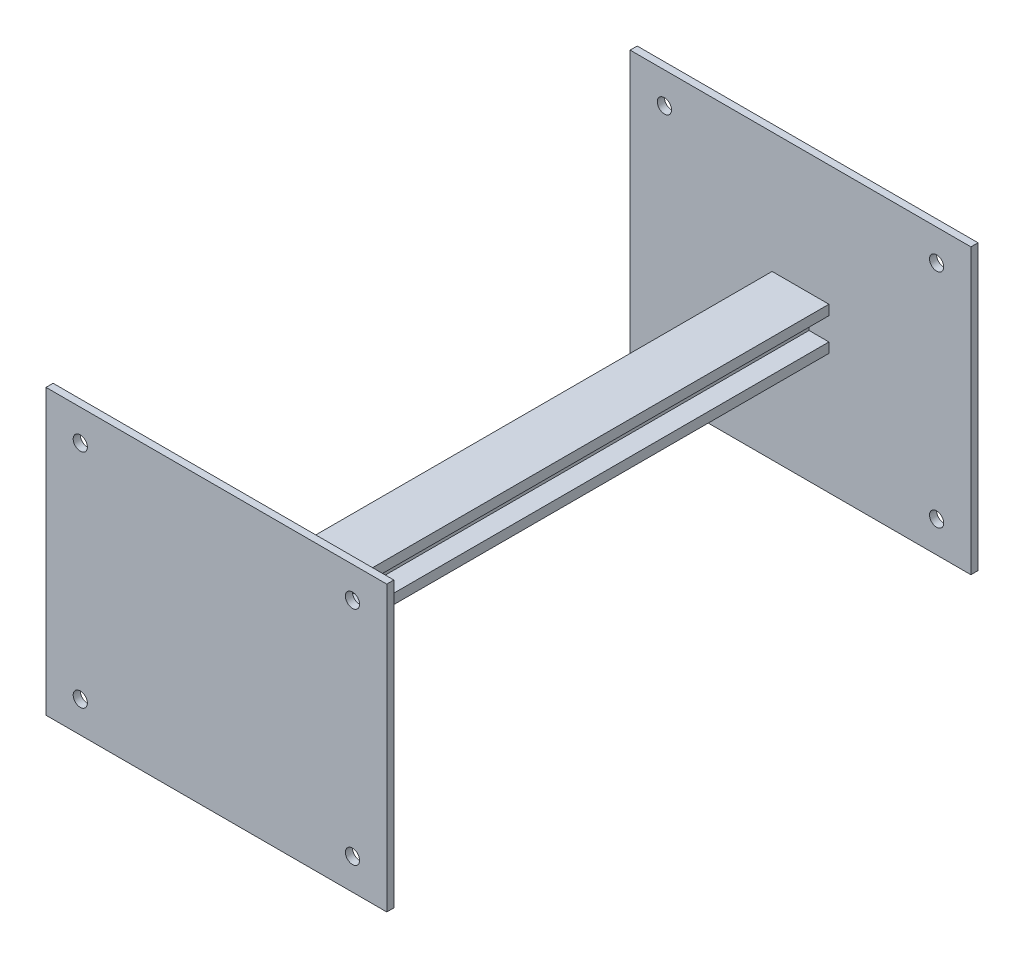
ISO-10303-21;
HEADER;
FILE_DESCRIPTION(('STEP AP214'),'2;1');
FILE_NAME('part.step','',(''),(''),'','','');
FILE_SCHEMA(('AUTOMOTIVE_DESIGN { 1 0 10303 214 1 1 1 1 }'));
ENDSEC;
DATA;
#1=APPLICATION_CONTEXT('core data for automotive mechanical design processes');
#2=APPLICATION_PROTOCOL_DEFINITION('international standard','automotive_design',2000,#1);
#3=PRODUCT_CONTEXT('',#1,'mechanical');
#4=PRODUCT('Part','Part','',(#3));
#5=PRODUCT_RELATED_PRODUCT_CATEGORY('part','',(#4));
#6=PRODUCT_DEFINITION_FORMATION('','',#4);
#7=PRODUCT_DEFINITION_CONTEXT('part definition',#1,'design');
#8=PRODUCT_DEFINITION('design','',#6,#7);
#9=PRODUCT_DEFINITION_SHAPE('','',#8);
#10=(LENGTH_UNIT() NAMED_UNIT(*) SI_UNIT(.MILLI.,.METRE.));
#11=(NAMED_UNIT(*) PLANE_ANGLE_UNIT() SI_UNIT($,.RADIAN.));
#12=(NAMED_UNIT(*) SI_UNIT($,.STERADIAN.) SOLID_ANGLE_UNIT());
#13=UNCERTAINTY_MEASURE_WITH_UNIT(LENGTH_MEASURE(1.E-05),#10,'distance_accuracy_value','');
#14=(GEOMETRIC_REPRESENTATION_CONTEXT(3) GLOBAL_UNCERTAINTY_ASSIGNED_CONTEXT((#13)) GLOBAL_UNIT_ASSIGNED_CONTEXT((#10,
#11,#12)) REPRESENTATION_CONTEXT('',''));
#15=CARTESIAN_POINT('',(0.,0.,0.));
#16=DIRECTION('',(0.,0.,1.));
#17=DIRECTION('',(1.,0.,0.));
#18=AXIS2_PLACEMENT_3D('',#15,#16,#17);
#19=CARTESIAN_POINT('',(-152.4,127.,-6.35));
#20=DIRECTION('',(1.,0.,0.));
#21=DIRECTION('',(0.,1.,0.));
#22=AXIS2_PLACEMENT_3D('',#19,#20,#21);
#23=PLANE('',#22);
#24=DIRECTION('',(0.,1.,0.));
#25=VECTOR('',#24,1.);
#26=CARTESIAN_POINT('',(-152.4,127.,0.));
#27=LINE('',#26,#25);
#28=CARTESIAN_POINT('',(-152.4,-127.,0.));
#29=VERTEX_POINT('',#28);
#30=CARTESIAN_POINT('',(-152.4,127.,0.));
#31=VERTEX_POINT('',#30);
#32=EDGE_CURVE('E112',#29,#31,#27,.T.);
#33=ORIENTED_EDGE('',*,*,#32,.T.);
#34=DIRECTION('',(0.,0.,1.));
#35=VECTOR('',#34,1.);
#36=CARTESIAN_POINT('',(-152.4,127.,-6.35));
#37=LINE('',#36,#35);
#38=CARTESIAN_POINT('',(-152.4,127.,-6.35));
#39=VERTEX_POINT('',#38);
#40=EDGE_CURVE('E12',#39,#31,#37,.T.);
#41=ORIENTED_EDGE('',*,*,#40,.F.);
#42=DIRECTION('',(0.,1.,0.));
#43=VECTOR('',#42,1.);
#44=CARTESIAN_POINT('',(-152.4,127.,-6.35));
#45=LINE('',#44,#43);
#46=CARTESIAN_POINT('',(-152.4,-127.,-6.35));
#47=VERTEX_POINT('',#46);
#48=EDGE_CURVE('E99',#47,#39,#45,.T.);
#49=ORIENTED_EDGE('',*,*,#48,.F.);
#50=DIRECTION('',(0.,0.,1.));
#51=VECTOR('',#50,1.);
#52=CARTESIAN_POINT('',(-152.4,-127.,-6.35));
#53=LINE('',#52,#51);
#54=EDGE_CURVE('E108',#47,#29,#53,.T.);
#55=ORIENTED_EDGE('',*,*,#54,.T.);
#56=EDGE_LOOP('',(#33,#41,#49,#55));
#57=FACE_BOUND('',#56,.T.);
#58=ADVANCED_FACE('F46',(#57),#23,.F.);
#59=CARTESIAN_POINT('',(152.4,127.,-6.35));
#60=DIRECTION('',(0.,-1.,0.));
#61=DIRECTION('',(0.,0.,-1.));
#62=AXIS2_PLACEMENT_3D('',#59,#60,#61);
#63=PLANE('',#62);
#64=DIRECTION('',(1.,0.,0.));
#65=VECTOR('',#64,1.);
#66=CARTESIAN_POINT('',(152.4,127.,0.));
#67=LINE('',#66,#65);
#68=CARTESIAN_POINT('',(152.4,127.,0.));
#69=VERTEX_POINT('',#68);
#70=EDGE_CURVE('E103',#31,#69,#67,.T.);
#71=ORIENTED_EDGE('',*,*,#70,.T.);
#72=DIRECTION('',(0.,0.,1.));
#73=VECTOR('',#72,1.);
#74=CARTESIAN_POINT('',(152.4,127.,-6.35));
#75=LINE('',#74,#73);
#76=CARTESIAN_POINT('',(152.4,127.,-6.35));
#77=VERTEX_POINT('',#76);
#78=EDGE_CURVE('E55',#77,#69,#75,.T.);
#79=ORIENTED_EDGE('',*,*,#78,.F.);
#80=DIRECTION('',(1.,0.,0.));
#81=VECTOR('',#80,1.);
#82=CARTESIAN_POINT('',(152.4,127.,-6.35));
#83=LINE('',#82,#81);
#84=EDGE_CURVE('E94',#39,#77,#83,.T.);
#85=ORIENTED_EDGE('',*,*,#84,.F.);
#86=ORIENTED_EDGE('',*,*,#40,.T.);
#87=EDGE_LOOP('',(#71,#79,#85,#86));
#88=FACE_BOUND('',#87,.T.);
#89=ADVANCED_FACE('F102',(#88),#63,.F.);
#90=CARTESIAN_POINT('',(152.4,127.,-6.35));
#91=DIRECTION('',(-1.,0.,0.));
#92=DIRECTION('',(0.,0.,1.));
#93=AXIS2_PLACEMENT_3D('',#90,#91,#92);
#94=PLANE('',#93);
#95=DIRECTION('',(0.,-1.,0.));
#96=VECTOR('',#95,1.);
#97=CARTESIAN_POINT('',(152.4,127.,0.));
#98=LINE('',#97,#96);
#99=CARTESIAN_POINT('',(152.4,-127.,0.));
#100=VERTEX_POINT('',#99);
#101=EDGE_CURVE('E81',#69,#100,#98,.T.);
#102=ORIENTED_EDGE('',*,*,#101,.T.);
#103=DIRECTION('',(0.,0.,1.));
#104=VECTOR('',#103,1.);
#105=CARTESIAN_POINT('',(152.4,-127.,-6.35));
#106=LINE('',#105,#104);
#107=CARTESIAN_POINT('',(152.4,-127.,-6.35));
#108=VERTEX_POINT('',#107);
#109=EDGE_CURVE('E104',#108,#100,#106,.T.);
#110=ORIENTED_EDGE('',*,*,#109,.F.);
#111=DIRECTION('',(0.,-1.,0.));
#112=VECTOR('',#111,1.);
#113=CARTESIAN_POINT('',(152.4,127.,-6.35));
#114=LINE('',#113,#112);
#115=EDGE_CURVE('E97',#77,#108,#114,.T.);
#116=ORIENTED_EDGE('',*,*,#115,.F.);
#117=ORIENTED_EDGE('',*,*,#78,.T.);
#118=EDGE_LOOP('',(#102,#110,#116,#117));
#119=FACE_BOUND('',#118,.T.);
#120=ADVANCED_FACE('F106',(#119),#94,.F.);
#121=CARTESIAN_POINT('',(152.4,-127.,-6.35));
#122=DIRECTION('',(0.,1.,0.));
#123=DIRECTION('',(0.,0.,1.));
#124=AXIS2_PLACEMENT_3D('',#121,#122,#123);
#125=PLANE('',#124);
#126=DIRECTION('',(-1.,0.,0.));
#127=VECTOR('',#126,1.);
#128=CARTESIAN_POINT('',(152.4,-127.,0.));
#129=LINE('',#128,#127);
#130=EDGE_CURVE('E87',#100,#29,#129,.T.);
#131=ORIENTED_EDGE('',*,*,#130,.T.);
#132=ORIENTED_EDGE('',*,*,#54,.F.);
#133=DIRECTION('',(-1.,0.,0.));
#134=VECTOR('',#133,1.);
#135=CARTESIAN_POINT('',(152.4,-127.,-6.35));
#136=LINE('',#135,#134);
#137=EDGE_CURVE('E64',#108,#47,#136,.T.);
#138=ORIENTED_EDGE('',*,*,#137,.F.);
#139=ORIENTED_EDGE('',*,*,#109,.T.);
#140=EDGE_LOOP('',(#131,#132,#138,#139));
#141=FACE_BOUND('',#140,.T.);
#142=ADVANCED_FACE('F163',(#141),#125,.F.);
#143=CARTESIAN_POINT('',(0.,0.,-6.35));
#144=DIRECTION('',(0.,0.,-1.));
#145=DIRECTION('',(-1.,0.,0.));
#146=AXIS2_PLACEMENT_3D('',#143,#144,#145);
#147=PLANE('',#146);
#148=CARTESIAN_POINT('',(121.732744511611,99.1913937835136,-6.34999999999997));
#149=DIRECTION('',(0.,0.,1.));
#150=DIRECTION('',(1.,0.,0.));
#151=AXIS2_PLACEMENT_3D('',#148,#149,#150);
#152=CIRCLE('',#151,6.34999999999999);
#153=CARTESIAN_POINT('',(128.082744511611,99.1913937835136,-6.34999999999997));
#154=VERTEX_POINT('',#153);
#155=EDGE_CURVE('E124',#154,#154,#152,.T.);
#156=ORIENTED_EDGE('',*,*,#155,.T.);
#157=EDGE_LOOP('',(#156));
#158=FACE_BOUND('',#157,.T.);
#159=CARTESIAN_POINT('',(121.732744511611,-99.1913937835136,-6.34999999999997));
#160=DIRECTION('',(0.,0.,1.));
#161=DIRECTION('',(-1.,0.,0.));
#162=AXIS2_PLACEMENT_3D('',#159,#160,#161);
#163=CIRCLE('',#162,6.34999999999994);
#164=CARTESIAN_POINT('',(115.382744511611,-99.1913937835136,-6.34999999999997));
#165=VERTEX_POINT('',#164);
#166=EDGE_CURVE('E225',#165,#165,#163,.T.);
#167=ORIENTED_EDGE('',*,*,#166,.T.);
#168=EDGE_LOOP('',(#167));
#169=FACE_BOUND('',#168,.T.);
#170=CARTESIAN_POINT('',(-121.732744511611,-99.1913937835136,-6.34999999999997));
#171=DIRECTION('',(0.,0.,1.));
#172=DIRECTION('',(1.,0.,0.));
#173=AXIS2_PLACEMENT_3D('',#170,#171,#172);
#174=CIRCLE('',#173,6.34999999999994);
#175=CARTESIAN_POINT('',(-115.382744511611,-99.1913937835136,-6.34999999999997));
#176=VERTEX_POINT('',#175);
#177=EDGE_CURVE('E218',#176,#176,#174,.T.);
#178=ORIENTED_EDGE('',*,*,#177,.T.);
#179=EDGE_LOOP('',(#178));
#180=FACE_BOUND('',#179,.T.);
#181=CARTESIAN_POINT('',(-121.732744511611,99.1913937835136,-6.34999999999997));
#182=DIRECTION('',(0.,0.,1.));
#183=DIRECTION('',(-1.,0.,0.));
#184=AXIS2_PLACEMENT_3D('',#181,#182,#183);
#185=CIRCLE('',#184,6.34999999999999);
#186=CARTESIAN_POINT('',(-128.082744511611,99.1913937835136,-6.34999999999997));
#187=VERTEX_POINT('',#186);
#188=EDGE_CURVE('E226',#187,#187,#185,.T.);
#189=ORIENTED_EDGE('',*,*,#188,.T.);
#190=EDGE_LOOP('',(#189));
#191=FACE_BOUND('',#190,.T.);
#192=ORIENTED_EDGE('',*,*,#48,.T.);
#193=ORIENTED_EDGE('',*,*,#84,.T.);
#194=ORIENTED_EDGE('',*,*,#115,.T.);
#195=ORIENTED_EDGE('',*,*,#137,.T.);
#196=EDGE_LOOP('',(#192,#193,#194,#195));
#197=FACE_BOUND('',#196,.T.);
#198=ADVANCED_FACE('F95',(#158,#169,#180,#191,#197),#147,.T.);
#199=CARTESIAN_POINT('',(0.,0.,0.));
#200=DIRECTION('',(0.,0.,-1.));
#201=DIRECTION('',(-1.,0.,0.));
#202=AXIS2_PLACEMENT_3D('',#199,#200,#201);
#203=PLANE('',#202);
#204=CARTESIAN_POINT('',(121.732744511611,99.1913937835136,0.));
#205=DIRECTION('',(0.,0.,-1.));
#206=DIRECTION('',(-1.,0.,0.));
#207=AXIS2_PLACEMENT_3D('',#204,#205,#206);
#208=CIRCLE('',#207,6.34999999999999);
#209=CARTESIAN_POINT('',(115.382744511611,99.1913937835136,0.));
#210=VERTEX_POINT('',#209);
#211=EDGE_CURVE('E49',#210,#210,#208,.T.);
#212=ORIENTED_EDGE('',*,*,#211,.T.);
#213=EDGE_LOOP('',(#212));
#214=FACE_BOUND('',#213,.T.);
#215=CARTESIAN_POINT('',(121.732744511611,-99.1913937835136,0.));
#216=DIRECTION('',(0.,0.,-1.));
#217=DIRECTION('',(-1.,0.,0.));
#218=AXIS2_PLACEMENT_3D('',#215,#216,#217);
#219=CIRCLE('',#218,6.34999999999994);
#220=CARTESIAN_POINT('',(115.382744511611,-99.1913937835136,0.));
#221=VERTEX_POINT('',#220);
#222=EDGE_CURVE('E126',#221,#221,#219,.T.);
#223=ORIENTED_EDGE('',*,*,#222,.T.);
#224=EDGE_LOOP('',(#223));
#225=FACE_BOUND('',#224,.T.);
#226=CARTESIAN_POINT('',(-121.732744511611,-99.1913937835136,0.));
#227=DIRECTION('',(0.,0.,-1.));
#228=DIRECTION('',(-1.,0.,0.));
#229=AXIS2_PLACEMENT_3D('',#226,#227,#228);
#230=CIRCLE('',#229,6.34999999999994);
#231=CARTESIAN_POINT('',(-128.082744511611,-99.1913937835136,0.));
#232=VERTEX_POINT('',#231);
#233=EDGE_CURVE('E123',#232,#232,#230,.T.);
#234=ORIENTED_EDGE('',*,*,#233,.T.);
#235=EDGE_LOOP('',(#234));
#236=FACE_BOUND('',#235,.T.);
#237=CARTESIAN_POINT('',(-121.732744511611,99.1913937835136,0.));
#238=DIRECTION('',(0.,0.,-1.));
#239=DIRECTION('',(-1.,0.,0.));
#240=AXIS2_PLACEMENT_3D('',#237,#238,#239);
#241=CIRCLE('',#240,6.34999999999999);
#242=CARTESIAN_POINT('',(-128.082744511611,99.1913937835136,0.));
#243=VERTEX_POINT('',#242);
#244=EDGE_CURVE('E120',#243,#243,#241,.T.);
#245=ORIENTED_EDGE('',*,*,#244,.T.);
#246=EDGE_LOOP('',(#245));
#247=FACE_BOUND('',#246,.T.);
#248=ORIENTED_EDGE('',*,*,#32,.F.);
#249=ORIENTED_EDGE('',*,*,#130,.F.);
#250=ORIENTED_EDGE('',*,*,#101,.F.);
#251=ORIENTED_EDGE('',*,*,#70,.F.);
#252=EDGE_LOOP('',(#248,#249,#250,#251));
#253=FACE_BOUND('',#252,.T.);
#254=ADVANCED_FACE('F133',(#214,#225,#236,#247,#253),#203,.F.);
#255=CARTESIAN_POINT('',(-121.732744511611,99.1913937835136,-6.34999999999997));
#256=DIRECTION('',(0.,0.,1.));
#257=DIRECTION('',(1.,0.,0.));
#258=AXIS2_PLACEMENT_3D('',#255,#256,#257);
#259=CYLINDRICAL_SURFACE('',#258,6.34999999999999);
#260=ORIENTED_EDGE('',*,*,#188,.F.);
#261=EDGE_LOOP('',(#260));
#262=FACE_BOUND('',#261,.T.);
#263=ORIENTED_EDGE('',*,*,#244,.F.);
#264=EDGE_LOOP('',(#263));
#265=FACE_BOUND('',#264,.T.);
#266=ADVANCED_FACE('F155',(#262,#265),#259,.F.);
#267=CARTESIAN_POINT('',(-121.732744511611,-99.1913937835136,-6.34999999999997));
#268=DIRECTION('',(0.,0.,1.));
#269=DIRECTION('',(1.,0.,0.));
#270=AXIS2_PLACEMENT_3D('',#267,#268,#269);
#271=CYLINDRICAL_SURFACE('',#270,6.34999999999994);
#272=ORIENTED_EDGE('',*,*,#177,.F.);
#273=EDGE_LOOP('',(#272));
#274=FACE_BOUND('',#273,.T.);
#275=ORIENTED_EDGE('',*,*,#233,.F.);
#276=EDGE_LOOP('',(#275));
#277=FACE_BOUND('',#276,.T.);
#278=ADVANCED_FACE('F143',(#274,#277),#271,.F.);
#279=CARTESIAN_POINT('',(121.732744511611,-99.1913937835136,-6.34999999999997));
#280=DIRECTION('',(0.,0.,1.));
#281=DIRECTION('',(1.,0.,0.));
#282=AXIS2_PLACEMENT_3D('',#279,#280,#281);
#283=CYLINDRICAL_SURFACE('',#282,6.34999999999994);
#284=ORIENTED_EDGE('',*,*,#166,.F.);
#285=EDGE_LOOP('',(#284));
#286=FACE_BOUND('',#285,.T.);
#287=ORIENTED_EDGE('',*,*,#222,.F.);
#288=EDGE_LOOP('',(#287));
#289=FACE_BOUND('',#288,.T.);
#290=ADVANCED_FACE('F137',(#286,#289),#283,.F.);
#291=CARTESIAN_POINT('',(121.732744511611,99.1913937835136,-6.34999999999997));
#292=DIRECTION('',(0.,0.,1.));
#293=DIRECTION('',(1.,0.,0.));
#294=AXIS2_PLACEMENT_3D('',#291,#292,#293);
#295=CYLINDRICAL_SURFACE('',#294,6.34999999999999);
#296=ORIENTED_EDGE('',*,*,#155,.F.);
#297=EDGE_LOOP('',(#296));
#298=FACE_BOUND('',#297,.T.);
#299=ORIENTED_EDGE('',*,*,#211,.F.);
#300=EDGE_LOOP('',(#299));
#301=FACE_BOUND('',#300,.T.);
#302=ADVANCED_FACE('F135',(#298,#301),#295,.F.);
#303=CLOSED_SHELL('',(#58,#89,#120,#142,#198,#254,#266,#278,#290,#302));
#304=MANIFOLD_SOLID_BREP('B2',#303);
#305=CARTESIAN_POINT('',(152.4,127.,522.477999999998));
#306=DIRECTION('',(-1.,0.,0.));
#307=DIRECTION('',(0.,-1.,0.));
#308=AXIS2_PLACEMENT_3D('',#305,#306,#307);
#309=PLANE('',#308);
#310=DIRECTION('',(0.,1.,0.));
#311=VECTOR('',#310,1.);
#312=CARTESIAN_POINT('',(152.4,127.,516.127999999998));
#313=LINE('',#312,#311);
#314=CARTESIAN_POINT('',(152.4,-127.,516.127999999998));
#315=VERTEX_POINT('',#314);
#316=CARTESIAN_POINT('',(152.4,127.,516.127999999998));
#317=VERTEX_POINT('',#316);
#318=EDGE_CURVE('E329',#315,#317,#313,.T.);
#319=ORIENTED_EDGE('',*,*,#318,.T.);
#320=DIRECTION('',(0.,0.,-1.));
#321=VECTOR('',#320,1.);
#322=CARTESIAN_POINT('',(152.4,127.,522.477999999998));
#323=LINE('',#322,#321);
#324=CARTESIAN_POINT('',(152.4,127.,522.477999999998));
#325=VERTEX_POINT('',#324);
#326=EDGE_CURVE('E44',#325,#317,#323,.T.);
#327=ORIENTED_EDGE('',*,*,#326,.F.);
#328=DIRECTION('',(0.,1.,0.));
#329=VECTOR('',#328,1.);
#330=CARTESIAN_POINT('',(152.4,127.,522.477999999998));
#331=LINE('',#330,#329);
#332=CARTESIAN_POINT('',(152.4,-127.,522.477999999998));
#333=VERTEX_POINT('',#332);
#334=EDGE_CURVE('E316',#333,#325,#331,.T.);
#335=ORIENTED_EDGE('',*,*,#334,.F.);
#336=DIRECTION('',(0.,0.,-1.));
#337=VECTOR('',#336,1.);
#338=CARTESIAN_POINT('',(152.4,-127.,522.477999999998));
#339=LINE('',#338,#337);
#340=EDGE_CURVE('E325',#333,#315,#339,.T.);
#341=ORIENTED_EDGE('',*,*,#340,.T.);
#342=EDGE_LOOP('',(#319,#327,#335,#341));
#343=FACE_BOUND('',#342,.T.);
#344=ADVANCED_FACE('F263',(#343),#309,.F.);
#345=CARTESIAN_POINT('',(-152.4,127.,522.477999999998));
#346=DIRECTION('',(0.,-1.,0.));
#347=DIRECTION('',(0.,0.,-1.));
#348=AXIS2_PLACEMENT_3D('',#345,#346,#347);
#349=PLANE('',#348);
#350=DIRECTION('',(-1.,0.,0.));
#351=VECTOR('',#350,1.);
#352=CARTESIAN_POINT('',(-152.4,127.,516.127999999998));
#353=LINE('',#352,#351);
#354=CARTESIAN_POINT('',(-152.4,127.,516.127999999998));
#355=VERTEX_POINT('',#354);
#356=EDGE_CURVE('E320',#317,#355,#353,.T.);
#357=ORIENTED_EDGE('',*,*,#356,.T.);
#358=DIRECTION('',(0.,0.,-1.));
#359=VECTOR('',#358,1.);
#360=CARTESIAN_POINT('',(-152.4,127.,522.477999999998));
#361=LINE('',#360,#359);
#362=CARTESIAN_POINT('',(-152.4,127.,522.477999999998));
#363=VERTEX_POINT('',#362);
#364=EDGE_CURVE('E272',#363,#355,#361,.T.);
#365=ORIENTED_EDGE('',*,*,#364,.F.);
#366=DIRECTION('',(-1.,0.,0.));
#367=VECTOR('',#366,1.);
#368=CARTESIAN_POINT('',(-152.4,127.,522.477999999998));
#369=LINE('',#368,#367);
#370=EDGE_CURVE('E311',#325,#363,#369,.T.);
#371=ORIENTED_EDGE('',*,*,#370,.F.);
#372=ORIENTED_EDGE('',*,*,#326,.T.);
#373=EDGE_LOOP('',(#357,#365,#371,#372));
#374=FACE_BOUND('',#373,.T.);
#375=ADVANCED_FACE('F319',(#374),#349,.F.);
#376=CARTESIAN_POINT('',(-152.4,127.,522.477999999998));
#377=DIRECTION('',(1.,0.,0.));
#378=DIRECTION('',(0.,1.,0.));
#379=AXIS2_PLACEMENT_3D('',#376,#377,#378);
#380=PLANE('',#379);
#381=DIRECTION('',(0.,-1.,0.));
#382=VECTOR('',#381,1.);
#383=CARTESIAN_POINT('',(-152.4,127.,516.127999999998));
#384=LINE('',#383,#382);
#385=CARTESIAN_POINT('',(-152.4,-127.,516.127999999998));
#386=VERTEX_POINT('',#385);
#387=EDGE_CURVE('E298',#355,#386,#384,.T.);
#388=ORIENTED_EDGE('',*,*,#387,.T.);
#389=DIRECTION('',(0.,0.,-1.));
#390=VECTOR('',#389,1.);
#391=CARTESIAN_POINT('',(-152.4,-127.,522.477999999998));
#392=LINE('',#391,#390);
#393=CARTESIAN_POINT('',(-152.4,-127.,522.477999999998));
#394=VERTEX_POINT('',#393);
#395=EDGE_CURVE('E321',#394,#386,#392,.T.);
#396=ORIENTED_EDGE('',*,*,#395,.F.);
#397=DIRECTION('',(0.,-1.,0.));
#398=VECTOR('',#397,1.);
#399=CARTESIAN_POINT('',(-152.4,127.,522.477999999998));
#400=LINE('',#399,#398);
#401=EDGE_CURVE('E314',#363,#394,#400,.T.);
#402=ORIENTED_EDGE('',*,*,#401,.F.);
#403=ORIENTED_EDGE('',*,*,#364,.T.);
#404=EDGE_LOOP('',(#388,#396,#402,#403));
#405=FACE_BOUND('',#404,.T.);
#406=ADVANCED_FACE('F323',(#405),#380,.F.);
#407=CARTESIAN_POINT('',(-152.4,-127.,522.477999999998));
#408=DIRECTION('',(0.,1.,0.));
#409=DIRECTION('',(0.,0.,1.));
#410=AXIS2_PLACEMENT_3D('',#407,#408,#409);
#411=PLANE('',#410);
#412=DIRECTION('',(1.,0.,0.));
#413=VECTOR('',#412,1.);
#414=CARTESIAN_POINT('',(-152.4,-127.,516.127999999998));
#415=LINE('',#414,#413);
#416=EDGE_CURVE('E304',#386,#315,#415,.T.);
#417=ORIENTED_EDGE('',*,*,#416,.T.);
#418=ORIENTED_EDGE('',*,*,#340,.F.);
#419=DIRECTION('',(1.,0.,0.));
#420=VECTOR('',#419,1.);
#421=CARTESIAN_POINT('',(-152.4,-127.,522.477999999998));
#422=LINE('',#421,#420);
#423=EDGE_CURVE('E281',#394,#333,#422,.T.);
#424=ORIENTED_EDGE('',*,*,#423,.F.);
#425=ORIENTED_EDGE('',*,*,#395,.T.);
#426=EDGE_LOOP('',(#417,#418,#424,#425));
#427=FACE_BOUND('',#426,.T.);
#428=ADVANCED_FACE('F380',(#427),#411,.F.);
#429=CARTESIAN_POINT('',(0.,0.,522.477999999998));
#430=DIRECTION('',(0.,0.,1.));
#431=DIRECTION('',(1.,0.,0.));
#432=AXIS2_PLACEMENT_3D('',#429,#430,#431);
#433=PLANE('',#432);
#434=CARTESIAN_POINT('',(121.732744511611,99.1913937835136,522.477999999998));
#435=DIRECTION('',(0.,0.,1.));
#436=DIRECTION('',(1.,0.,0.));
#437=AXIS2_PLACEMENT_3D('',#434,#435,#436);
#438=CIRCLE('',#437,6.34999999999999);
#439=CARTESIAN_POINT('',(128.082744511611,99.1913937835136,522.477999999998));
#440=VERTEX_POINT('',#439);
#441=EDGE_CURVE('E341',#440,#440,#438,.T.);
#442=ORIENTED_EDGE('',*,*,#441,.F.);
#443=EDGE_LOOP('',(#442));
#444=FACE_BOUND('',#443,.T.);
#445=CARTESIAN_POINT('',(121.732744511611,-99.1913937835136,522.477999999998));
#446=DIRECTION('',(0.,0.,1.));
#447=DIRECTION('',(-1.,0.,0.));
#448=AXIS2_PLACEMENT_3D('',#445,#446,#447);
#449=CIRCLE('',#448,6.34999999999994);
#450=CARTESIAN_POINT('',(115.382744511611,-99.1913937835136,522.477999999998));
#451=VERTEX_POINT('',#450);
#452=EDGE_CURVE('E442',#451,#451,#449,.T.);
#453=ORIENTED_EDGE('',*,*,#452,.F.);
#454=EDGE_LOOP('',(#453));
#455=FACE_BOUND('',#454,.T.);
#456=CARTESIAN_POINT('',(-121.732744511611,-99.1913937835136,522.477999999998));
#457=DIRECTION('',(0.,0.,1.));
#458=DIRECTION('',(1.,0.,0.));
#459=AXIS2_PLACEMENT_3D('',#456,#457,#458);
#460=CIRCLE('',#459,6.34999999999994);
#461=CARTESIAN_POINT('',(-115.382744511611,-99.1913937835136,522.477999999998));
#462=VERTEX_POINT('',#461);
#463=EDGE_CURVE('E435',#462,#462,#460,.T.);
#464=ORIENTED_EDGE('',*,*,#463,.F.);
#465=EDGE_LOOP('',(#464));
#466=FACE_BOUND('',#465,.T.);
#467=CARTESIAN_POINT('',(-121.732744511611,99.1913937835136,522.477999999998));
#468=DIRECTION('',(0.,0.,1.));
#469=DIRECTION('',(-1.,0.,0.));
#470=AXIS2_PLACEMENT_3D('',#467,#468,#469);
#471=CIRCLE('',#470,6.34999999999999);
#472=CARTESIAN_POINT('',(-128.082744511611,99.1913937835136,522.477999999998));
#473=VERTEX_POINT('',#472);
#474=EDGE_CURVE('E443',#473,#473,#471,.T.);
#475=ORIENTED_EDGE('',*,*,#474,.F.);
#476=EDGE_LOOP('',(#475));
#477=FACE_BOUND('',#476,.T.);
#478=ORIENTED_EDGE('',*,*,#334,.T.);
#479=ORIENTED_EDGE('',*,*,#370,.T.);
#480=ORIENTED_EDGE('',*,*,#401,.T.);
#481=ORIENTED_EDGE('',*,*,#423,.T.);
#482=EDGE_LOOP('',(#478,#479,#480,#481));
#483=FACE_BOUND('',#482,.T.);
#484=ADVANCED_FACE('F312',(#444,#455,#466,#477,#483),#433,.T.);
#485=CARTESIAN_POINT('',(0.,0.,516.127999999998));
#486=DIRECTION('',(0.,0.,1.));
#487=DIRECTION('',(1.,0.,0.));
#488=AXIS2_PLACEMENT_3D('',#485,#486,#487);
#489=PLANE('',#488);
#490=CARTESIAN_POINT('',(121.732744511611,99.1913937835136,516.127999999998));
#491=DIRECTION('',(0.,0.,1.));
#492=DIRECTION('',(1.,0.,0.));
#493=AXIS2_PLACEMENT_3D('',#490,#491,#492);
#494=CIRCLE('',#493,6.34999999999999);
#495=CARTESIAN_POINT('',(128.082744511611,99.1913937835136,516.127999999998));
#496=VERTEX_POINT('',#495);
#497=EDGE_CURVE('E266',#496,#496,#494,.T.);
#498=ORIENTED_EDGE('',*,*,#497,.T.);
#499=EDGE_LOOP('',(#498));
#500=FACE_BOUND('',#499,.T.);
#501=CARTESIAN_POINT('',(121.732744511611,-99.1913937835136,516.127999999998));
#502=DIRECTION('',(0.,0.,1.));
#503=DIRECTION('',(1.,0.,0.));
#504=AXIS2_PLACEMENT_3D('',#501,#502,#503);
#505=CIRCLE('',#504,6.34999999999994);
#506=CARTESIAN_POINT('',(128.082744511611,-99.1913937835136,516.127999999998));
#507=VERTEX_POINT('',#506);
#508=EDGE_CURVE('E343',#507,#507,#505,.T.);
#509=ORIENTED_EDGE('',*,*,#508,.T.);
#510=EDGE_LOOP('',(#509));
#511=FACE_BOUND('',#510,.T.);
#512=CARTESIAN_POINT('',(-121.732744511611,-99.1913937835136,516.127999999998));
#513=DIRECTION('',(0.,0.,1.));
#514=DIRECTION('',(1.,0.,0.));
#515=AXIS2_PLACEMENT_3D('',#512,#513,#514);
#516=CIRCLE('',#515,6.34999999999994);
#517=CARTESIAN_POINT('',(-115.382744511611,-99.1913937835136,516.127999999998));
#518=VERTEX_POINT('',#517);
#519=EDGE_CURVE('E340',#518,#518,#516,.T.);
#520=ORIENTED_EDGE('',*,*,#519,.T.);
#521=EDGE_LOOP('',(#520));
#522=FACE_BOUND('',#521,.T.);
#523=CARTESIAN_POINT('',(-121.732744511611,99.1913937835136,516.127999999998));
#524=DIRECTION('',(0.,0.,1.));
#525=DIRECTION('',(1.,0.,0.));
#526=AXIS2_PLACEMENT_3D('',#523,#524,#525);
#527=CIRCLE('',#526,6.34999999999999);
#528=CARTESIAN_POINT('',(-115.382744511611,99.1913937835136,516.127999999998));
#529=VERTEX_POINT('',#528);
#530=EDGE_CURVE('E337',#529,#529,#527,.T.);
#531=ORIENTED_EDGE('',*,*,#530,.T.);
#532=EDGE_LOOP('',(#531));
#533=FACE_BOUND('',#532,.T.);
#534=ORIENTED_EDGE('',*,*,#318,.F.);
#535=ORIENTED_EDGE('',*,*,#416,.F.);
#536=ORIENTED_EDGE('',*,*,#387,.F.);
#537=ORIENTED_EDGE('',*,*,#356,.F.);
#538=EDGE_LOOP('',(#534,#535,#536,#537));
#539=FACE_BOUND('',#538,.T.);
#540=ADVANCED_FACE('F350',(#500,#511,#522,#533,#539),#489,.F.);
#541=CARTESIAN_POINT('',(-121.732744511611,99.1913937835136,-6.34999999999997));
#542=DIRECTION('',(0.,0.,1.));
#543=DIRECTION('',(1.,0.,0.));
#544=AXIS2_PLACEMENT_3D('',#541,#542,#543);
#545=CYLINDRICAL_SURFACE('',#544,6.34999999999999);
#546=ORIENTED_EDGE('',*,*,#474,.T.);
#547=EDGE_LOOP('',(#546));
#548=FACE_BOUND('',#547,.T.);
#549=ORIENTED_EDGE('',*,*,#530,.F.);
#550=EDGE_LOOP('',(#549));
#551=FACE_BOUND('',#550,.T.);
#552=ADVANCED_FACE('F372',(#548,#551),#545,.F.);
#553=CARTESIAN_POINT('',(-121.732744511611,-99.1913937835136,-6.34999999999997));
#554=DIRECTION('',(0.,0.,1.));
#555=DIRECTION('',(1.,0.,0.));
#556=AXIS2_PLACEMENT_3D('',#553,#554,#555);
#557=CYLINDRICAL_SURFACE('',#556,6.34999999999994);
#558=ORIENTED_EDGE('',*,*,#463,.T.);
#559=EDGE_LOOP('',(#558));
#560=FACE_BOUND('',#559,.T.);
#561=ORIENTED_EDGE('',*,*,#519,.F.);
#562=EDGE_LOOP('',(#561));
#563=FACE_BOUND('',#562,.T.);
#564=ADVANCED_FACE('F360',(#560,#563),#557,.F.);
#565=CARTESIAN_POINT('',(121.732744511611,-99.1913937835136,-6.34999999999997));
#566=DIRECTION('',(0.,0.,1.));
#567=DIRECTION('',(1.,0.,0.));
#568=AXIS2_PLACEMENT_3D('',#565,#566,#567);
#569=CYLINDRICAL_SURFACE('',#568,6.34999999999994);
#570=ORIENTED_EDGE('',*,*,#452,.T.);
#571=EDGE_LOOP('',(#570));
#572=FACE_BOUND('',#571,.T.);
#573=ORIENTED_EDGE('',*,*,#508,.F.);
#574=EDGE_LOOP('',(#573));
#575=FACE_BOUND('',#574,.T.);
#576=ADVANCED_FACE('F354',(#572,#575),#569,.F.);
#577=CARTESIAN_POINT('',(121.732744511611,99.1913937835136,-6.34999999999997));
#578=DIRECTION('',(0.,0.,1.));
#579=DIRECTION('',(1.,0.,0.));
#580=AXIS2_PLACEMENT_3D('',#577,#578,#579);
#581=CYLINDRICAL_SURFACE('',#580,6.34999999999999);
#582=ORIENTED_EDGE('',*,*,#441,.T.);
#583=EDGE_LOOP('',(#582));
#584=FACE_BOUND('',#583,.T.);
#585=ORIENTED_EDGE('',*,*,#497,.F.);
#586=EDGE_LOOP('',(#585));
#587=FACE_BOUND('',#586,.T.);
#588=ADVANCED_FACE('F352',(#584,#587),#581,.F.);
#589=CLOSED_SHELL('',(#344,#375,#406,#428,#484,#540,#552,#564,#576,#588));
#590=MANIFOLD_SOLID_BREP('B6',#589);
#591=CARTESIAN_POINT('',(25.4,-10.16,516.127999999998));
#592=DIRECTION('',(-1.,0.,0.));
#593=DIRECTION('',(0.,-1.,0.));
#594=AXIS2_PLACEMENT_3D('',#591,#592,#593);
#595=PLANE('',#594);
#596=DIRECTION('',(0.,1.,0.));
#597=VECTOR('',#596,1.);
#598=CARTESIAN_POINT('',(25.4,-10.16,0.));
#599=LINE('',#598,#597);
#600=CARTESIAN_POINT('',(25.4,-19.05,0.));
#601=VERTEX_POINT('',#600);
#602=CARTESIAN_POINT('',(25.4,-10.16,0.));
#603=VERTEX_POINT('',#602);
#604=EDGE_CURVE('E591',#601,#603,#599,.T.);
#605=ORIENTED_EDGE('',*,*,#604,.T.);
#606=DIRECTION('',(0.,0.,-1.));
#607=VECTOR('',#606,1.);
#608=CARTESIAN_POINT('',(25.4,-10.16,516.127999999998));
#609=LINE('',#608,#607);
#610=CARTESIAN_POINT('',(25.4,-10.16,516.127999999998));
#611=VERTEX_POINT('',#610);
#612=EDGE_CURVE('E261',#611,#603,#609,.T.);
#613=ORIENTED_EDGE('',*,*,#612,.F.);
#614=DIRECTION('',(0.,1.,0.));
#615=VECTOR('',#614,1.);
#616=CARTESIAN_POINT('',(25.4,-10.16,516.127999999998));
#617=LINE('',#616,#615);
#618=CARTESIAN_POINT('',(25.4,-19.05,516.127999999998));
#619=VERTEX_POINT('',#618);
#620=EDGE_CURVE('E613',#619,#611,#617,.T.);
#621=ORIENTED_EDGE('',*,*,#620,.F.);
#622=DIRECTION('',(0.,0.,-1.));
#623=VECTOR('',#622,1.);
#624=CARTESIAN_POINT('',(25.4,-19.05,516.127999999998));
#625=LINE('',#624,#623);
#626=EDGE_CURVE('E587',#619,#601,#625,.T.);
#627=ORIENTED_EDGE('',*,*,#626,.T.);
#628=EDGE_LOOP('',(#605,#613,#621,#627));
#629=FACE_BOUND('',#628,.T.);
#630=ADVANCED_FACE('F471',(#629),#595,.F.);
#631=CARTESIAN_POINT('',(7.61999999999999,-10.16,516.127999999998));
#632=DIRECTION('',(0.,-1.,0.));
#633=DIRECTION('',(0.,0.,-1.));
#634=AXIS2_PLACEMENT_3D('',#631,#632,#633);
#635=PLANE('',#634);
#636=DIRECTION('',(-1.,0.,0.));
#637=VECTOR('',#636,1.);
#638=CARTESIAN_POINT('',(7.61999999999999,-10.16,0.));
#639=LINE('',#638,#637);
#640=CARTESIAN_POINT('',(7.61999999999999,-10.16,0.));
#641=VERTEX_POINT('',#640);
#642=EDGE_CURVE('E594',#603,#641,#639,.T.);
#643=ORIENTED_EDGE('',*,*,#642,.T.);
#644=DIRECTION('',(0.,0.,-1.));
#645=VECTOR('',#644,1.);
#646=CARTESIAN_POINT('',(7.61999999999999,-10.16,516.127999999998));
#647=LINE('',#646,#645);
#648=CARTESIAN_POINT('',(7.61999999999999,-10.16,516.127999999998));
#649=VERTEX_POINT('',#648);
#650=EDGE_CURVE('E479',#649,#641,#647,.T.);
#651=ORIENTED_EDGE('',*,*,#650,.F.);
#652=DIRECTION('',(-1.,0.,0.));
#653=VECTOR('',#652,1.);
#654=CARTESIAN_POINT('',(7.61999999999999,-10.16,516.127999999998));
#655=LINE('',#654,#653);
#656=EDGE_CURVE('E542',#611,#649,#655,.T.);
#657=ORIENTED_EDGE('',*,*,#656,.F.);
#658=ORIENTED_EDGE('',*,*,#612,.T.);
#659=EDGE_LOOP('',(#643,#651,#657,#658));
#660=FACE_BOUND('',#659,.T.);
#661=ADVANCED_FACE('F691',(#660),#635,.F.);
#662=CARTESIAN_POINT('',(7.61999999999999,10.16,516.127999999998));
#663=DIRECTION('',(-1.,0.,0.));
#664=DIRECTION('',(0.,0.,1.));
#665=AXIS2_PLACEMENT_3D('',#662,#663,#664);
#666=PLANE('',#665);
#667=DIRECTION('',(0.,1.,0.));
#668=VECTOR('',#667,1.);
#669=CARTESIAN_POINT('',(7.61999999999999,10.16,0.));
#670=LINE('',#669,#668);
#671=CARTESIAN_POINT('',(7.61999999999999,10.16,0.));
#672=VERTEX_POINT('',#671);
#673=EDGE_CURVE('E596',#641,#672,#670,.T.);
#674=ORIENTED_EDGE('',*,*,#673,.T.);
#675=DIRECTION('',(0.,0.,-1.));
#676=VECTOR('',#675,1.);
#677=CARTESIAN_POINT('',(7.61999999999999,10.16,516.127999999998));
#678=LINE('',#677,#676);
#679=CARTESIAN_POINT('',(7.61999999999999,10.16,516.127999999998));
#680=VERTEX_POINT('',#679);
#681=EDGE_CURVE('E632',#680,#672,#678,.T.);
#682=ORIENTED_EDGE('',*,*,#681,.F.);
#683=DIRECTION('',(0.,1.,0.));
#684=VECTOR('',#683,1.);
#685=CARTESIAN_POINT('',(7.61999999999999,10.16,516.127999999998));
#686=LINE('',#685,#684);
#687=EDGE_CURVE('E640',#649,#680,#686,.T.);
#688=ORIENTED_EDGE('',*,*,#687,.F.);
#689=ORIENTED_EDGE('',*,*,#650,.T.);
#690=EDGE_LOOP('',(#674,#682,#688,#689));
#691=FACE_BOUND('',#690,.T.);
#692=ADVANCED_FACE('F638',(#691),#666,.F.);
#693=CARTESIAN_POINT('',(7.61999999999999,10.16,516.127999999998));
#694=DIRECTION('',(0.,1.,0.));
#695=DIRECTION('',(0.,0.,1.));
#696=AXIS2_PLACEMENT_3D('',#693,#694,#695);
#697=PLANE('',#696);
#698=DIRECTION('',(1.,0.,0.));
#699=VECTOR('',#698,1.);
#700=CARTESIAN_POINT('',(7.61999999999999,10.16,0.));
#701=LINE('',#700,#699);
#702=CARTESIAN_POINT('',(25.4,10.16,0.));
#703=VERTEX_POINT('',#702);
#704=EDGE_CURVE('E598',#672,#703,#701,.T.);
#705=ORIENTED_EDGE('',*,*,#704,.T.);
#706=DIRECTION('',(0.,0.,-1.));
#707=VECTOR('',#706,1.);
#708=CARTESIAN_POINT('',(25.4,10.16,516.127999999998));
#709=LINE('',#708,#707);
#710=CARTESIAN_POINT('',(25.4,10.16,516.127999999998));
#711=VERTEX_POINT('',#710);
#712=EDGE_CURVE('E629',#711,#703,#709,.T.);
#713=ORIENTED_EDGE('',*,*,#712,.F.);
#714=DIRECTION('',(1.,0.,0.));
#715=VECTOR('',#714,1.);
#716=CARTESIAN_POINT('',(7.61999999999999,10.16,516.127999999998));
#717=LINE('',#716,#715);
#718=EDGE_CURVE('E658',#680,#711,#717,.T.);
#719=ORIENTED_EDGE('',*,*,#718,.F.);
#720=ORIENTED_EDGE('',*,*,#681,.T.);
#721=EDGE_LOOP('',(#705,#713,#719,#720));
#722=FACE_BOUND('',#721,.T.);
#723=ADVANCED_FACE('F649',(#722),#697,.F.);
#724=CARTESIAN_POINT('',(25.4,10.16,516.127999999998));
#725=DIRECTION('',(-1.,0.,0.));
#726=DIRECTION('',(0.,-1.,0.));
#727=AXIS2_PLACEMENT_3D('',#724,#725,#726);
#728=PLANE('',#727);
#729=DIRECTION('',(0.,1.,0.));
#730=VECTOR('',#729,1.);
#731=CARTESIAN_POINT('',(25.4,10.16,0.));
#732=LINE('',#731,#730);
#733=CARTESIAN_POINT('',(25.4,19.05,0.));
#734=VERTEX_POINT('',#733);
#735=EDGE_CURVE('E600',#703,#734,#732,.T.);
#736=ORIENTED_EDGE('',*,*,#735,.T.);
#737=DIRECTION('',(0.,0.,-1.));
#738=VECTOR('',#737,1.);
#739=CARTESIAN_POINT('',(25.4,19.05,516.127999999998));
#740=LINE('',#739,#738);
#741=CARTESIAN_POINT('',(25.4,19.05,516.127999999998));
#742=VERTEX_POINT('',#741);
#743=EDGE_CURVE('E626',#742,#734,#740,.T.);
#744=ORIENTED_EDGE('',*,*,#743,.F.);
#745=DIRECTION('',(0.,1.,0.));
#746=VECTOR('',#745,1.);
#747=CARTESIAN_POINT('',(25.4,10.16,516.127999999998));
#748=LINE('',#747,#746);
#749=EDGE_CURVE('E655',#711,#742,#748,.T.);
#750=ORIENTED_EDGE('',*,*,#749,.F.);
#751=ORIENTED_EDGE('',*,*,#712,.T.);
#752=EDGE_LOOP('',(#736,#744,#750,#751));
#753=FACE_BOUND('',#752,.T.);
#754=ADVANCED_FACE('F653',(#753),#728,.F.);
#755=CARTESIAN_POINT('',(-25.4,19.05,516.127999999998));
#756=DIRECTION('',(0.,-1.,0.));
#757=DIRECTION('',(0.,0.,-1.));
#758=AXIS2_PLACEMENT_3D('',#755,#756,#757);
#759=PLANE('',#758);
#760=DIRECTION('',(-1.,0.,0.));
#761=VECTOR('',#760,1.);
#762=CARTESIAN_POINT('',(-25.4,19.05,0.));
#763=LINE('',#762,#761);
#764=CARTESIAN_POINT('',(-25.4,19.05,0.));
#765=VERTEX_POINT('',#764);
#766=EDGE_CURVE('E602',#734,#765,#763,.T.);
#767=ORIENTED_EDGE('',*,*,#766,.T.);
#768=DIRECTION('',(0.,0.,-1.));
#769=VECTOR('',#768,1.);
#770=CARTESIAN_POINT('',(-25.4,19.05,516.127999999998));
#771=LINE('',#770,#769);
#772=CARTESIAN_POINT('',(-25.4,19.05,516.127999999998));
#773=VERTEX_POINT('',#772);
#774=EDGE_CURVE('E623',#773,#765,#771,.T.);
#775=ORIENTED_EDGE('',*,*,#774,.F.);
#776=DIRECTION('',(-1.,0.,0.));
#777=VECTOR('',#776,1.);
#778=CARTESIAN_POINT('',(-25.4,19.05,516.127999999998));
#779=LINE('',#778,#777);
#780=EDGE_CURVE('E657',#742,#773,#779,.T.);
#781=ORIENTED_EDGE('',*,*,#780,.F.);
#782=ORIENTED_EDGE('',*,*,#743,.T.);
#783=EDGE_LOOP('',(#767,#775,#781,#782));
#784=FACE_BOUND('',#783,.T.);
#785=ADVANCED_FACE('F704',(#784),#759,.F.);
#786=CARTESIAN_POINT('',(-25.4,10.16,516.127999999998));
#787=DIRECTION('',(1.,0.,0.));
#788=DIRECTION('',(0.,1.,0.));
#789=AXIS2_PLACEMENT_3D('',#786,#787,#788);
#790=PLANE('',#789);
#791=DIRECTION('',(0.,-1.,0.));
#792=VECTOR('',#791,1.);
#793=CARTESIAN_POINT('',(-25.4,10.16,0.));
#794=LINE('',#793,#792);
#795=CARTESIAN_POINT('',(-25.4,10.16,0.));
#796=VERTEX_POINT('',#795);
#797=EDGE_CURVE('E604',#765,#796,#794,.T.);
#798=ORIENTED_EDGE('',*,*,#797,.T.);
#799=DIRECTION('',(0.,0.,-1.));
#800=VECTOR('',#799,1.);
#801=CARTESIAN_POINT('',(-25.4,10.16,516.127999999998));
#802=LINE('',#801,#800);
#803=CARTESIAN_POINT('',(-25.4,10.16,516.127999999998));
#804=VERTEX_POINT('',#803);
#805=EDGE_CURVE('E620',#804,#796,#802,.T.);
#806=ORIENTED_EDGE('',*,*,#805,.F.);
#807=DIRECTION('',(0.,-1.,0.));
#808=VECTOR('',#807,1.);
#809=CARTESIAN_POINT('',(-25.4,10.16,516.127999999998));
#810=LINE('',#809,#808);
#811=EDGE_CURVE('E660',#773,#804,#810,.T.);
#812=ORIENTED_EDGE('',*,*,#811,.F.);
#813=ORIENTED_EDGE('',*,*,#774,.T.);
#814=EDGE_LOOP('',(#798,#806,#812,#813));
#815=FACE_BOUND('',#814,.T.);
#816=ADVANCED_FACE('F707',(#815),#790,.F.);
#817=CARTESIAN_POINT('',(-7.61999999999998,10.16,516.127999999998));
#818=DIRECTION('',(0.,1.,0.));
#819=DIRECTION('',(-1.,0.,0.));
#820=AXIS2_PLACEMENT_3D('',#817,#818,#819);
#821=PLANE('',#820);
#822=DIRECTION('',(1.,0.,0.));
#823=VECTOR('',#822,1.);
#824=CARTESIAN_POINT('',(-7.61999999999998,10.16,0.));
#825=LINE('',#824,#823);
#826=CARTESIAN_POINT('',(-7.61999999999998,10.16,0.));
#827=VERTEX_POINT('',#826);
#828=EDGE_CURVE('E606',#796,#827,#825,.T.);
#829=ORIENTED_EDGE('',*,*,#828,.T.);
#830=DIRECTION('',(0.,0.,-1.));
#831=VECTOR('',#830,1.);
#832=CARTESIAN_POINT('',(-7.61999999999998,10.16,516.127999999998));
#833=LINE('',#832,#831);
#834=CARTESIAN_POINT('',(-7.61999999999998,10.16,516.127999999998));
#835=VERTEX_POINT('',#834);
#836=EDGE_CURVE('E617',#835,#827,#833,.T.);
#837=ORIENTED_EDGE('',*,*,#836,.F.);
#838=DIRECTION('',(1.,0.,0.));
#839=VECTOR('',#838,1.);
#840=CARTESIAN_POINT('',(-7.61999999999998,10.16,516.127999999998));
#841=LINE('',#840,#839);
#842=EDGE_CURVE('E666',#804,#835,#841,.T.);
#843=ORIENTED_EDGE('',*,*,#842,.F.);
#844=ORIENTED_EDGE('',*,*,#805,.T.);
#845=EDGE_LOOP('',(#829,#837,#843,#844));
#846=FACE_BOUND('',#845,.T.);
#847=ADVANCED_FACE('F672',(#846),#821,.F.);
#848=CARTESIAN_POINT('',(-7.61999999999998,10.16,516.127999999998));
#849=DIRECTION('',(1.,0.,0.));
#850=DIRECTION('',(0.,1.,0.));
#851=AXIS2_PLACEMENT_3D('',#848,#849,#850);
#852=PLANE('',#851);
#853=DIRECTION('',(0.,-1.,0.));
#854=VECTOR('',#853,1.);
#855=CARTESIAN_POINT('',(-7.61999999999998,10.16,0.));
#856=LINE('',#855,#854);
#857=CARTESIAN_POINT('',(-7.61999999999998,-10.16,0.));
#858=VERTEX_POINT('',#857);
#859=EDGE_CURVE('E608',#827,#858,#856,.T.);
#860=ORIENTED_EDGE('',*,*,#859,.T.);
#861=DIRECTION('',(0.,0.,-1.));
#862=VECTOR('',#861,1.);
#863=CARTESIAN_POINT('',(-7.61999999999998,-10.16,516.127999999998));
#864=LINE('',#863,#862);
#865=CARTESIAN_POINT('',(-7.61999999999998,-10.16,516.127999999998));
#866=VERTEX_POINT('',#865);
#867=EDGE_CURVE('E582',#866,#858,#864,.T.);
#868=ORIENTED_EDGE('',*,*,#867,.F.);
#869=DIRECTION('',(0.,-1.,0.));
#870=VECTOR('',#869,1.);
#871=CARTESIAN_POINT('',(-7.61999999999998,10.16,516.127999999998));
#872=LINE('',#871,#870);
#873=EDGE_CURVE('E573',#835,#866,#872,.T.);
#874=ORIENTED_EDGE('',*,*,#873,.F.);
#875=ORIENTED_EDGE('',*,*,#836,.T.);
#876=EDGE_LOOP('',(#860,#868,#874,#875));
#877=FACE_BOUND('',#876,.T.);
#878=ADVANCED_FACE('F676',(#877),#852,.F.);
#879=CARTESIAN_POINT('',(-7.61999999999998,-10.16,516.127999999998));
#880=DIRECTION('',(0.,-1.,0.));
#881=DIRECTION('',(1.,0.,0.));
#882=AXIS2_PLACEMENT_3D('',#879,#880,#881);
#883=PLANE('',#882);
#884=DIRECTION('',(-1.,0.,0.));
#885=VECTOR('',#884,1.);
#886=CARTESIAN_POINT('',(-7.61999999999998,-10.16,0.));
#887=LINE('',#886,#885);
#888=CARTESIAN_POINT('',(-25.4,-10.16,0.));
#889=VERTEX_POINT('',#888);
#890=EDGE_CURVE('E581',#858,#889,#887,.T.);
#891=ORIENTED_EDGE('',*,*,#890,.T.);
#892=DIRECTION('',(0.,0.,-1.));
#893=VECTOR('',#892,1.);
#894=CARTESIAN_POINT('',(-25.4,-10.16,516.127999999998));
#895=LINE('',#894,#893);
#896=CARTESIAN_POINT('',(-25.4,-10.16,516.127999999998));
#897=VERTEX_POINT('',#896);
#898=EDGE_CURVE('E578',#897,#889,#895,.T.);
#899=ORIENTED_EDGE('',*,*,#898,.F.);
#900=DIRECTION('',(-1.,0.,0.));
#901=VECTOR('',#900,1.);
#902=CARTESIAN_POINT('',(-7.61999999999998,-10.16,516.127999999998));
#903=LINE('',#902,#901);
#904=EDGE_CURVE('E567',#866,#897,#903,.T.);
#905=ORIENTED_EDGE('',*,*,#904,.F.);
#906=ORIENTED_EDGE('',*,*,#867,.T.);
#907=EDGE_LOOP('',(#891,#899,#905,#906));
#908=FACE_BOUND('',#907,.T.);
#909=ADVANCED_FACE('F579',(#908),#883,.F.);
#910=CARTESIAN_POINT('',(-25.4,-10.16,516.127999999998));
#911=DIRECTION('',(1.,0.,0.));
#912=DIRECTION('',(0.,1.,0.));
#913=AXIS2_PLACEMENT_3D('',#910,#911,#912);
#914=PLANE('',#913);
#915=DIRECTION('',(0.,-1.,0.));
#916=VECTOR('',#915,1.);
#917=CARTESIAN_POINT('',(-25.4,-10.16,0.));
#918=LINE('',#917,#916);
#919=CARTESIAN_POINT('',(-25.4,-19.05,0.));
#920=VERTEX_POINT('',#919);
#921=EDGE_CURVE('E528',#889,#920,#918,.T.);
#922=ORIENTED_EDGE('',*,*,#921,.T.);
#923=DIRECTION('',(0.,0.,-1.));
#924=VECTOR('',#923,1.);
#925=CARTESIAN_POINT('',(-25.4,-19.05,516.127999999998));
#926=LINE('',#925,#924);
#927=CARTESIAN_POINT('',(-25.4,-19.05,516.127999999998));
#928=VERTEX_POINT('',#927);
#929=EDGE_CURVE('E583',#928,#920,#926,.T.);
#930=ORIENTED_EDGE('',*,*,#929,.F.);
#931=DIRECTION('',(0.,-1.,0.));
#932=VECTOR('',#931,1.);
#933=CARTESIAN_POINT('',(-25.4,-10.16,516.127999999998));
#934=LINE('',#933,#932);
#935=EDGE_CURVE('E571',#897,#928,#934,.T.);
#936=ORIENTED_EDGE('',*,*,#935,.F.);
#937=ORIENTED_EDGE('',*,*,#898,.T.);
#938=EDGE_LOOP('',(#922,#930,#936,#937));
#939=FACE_BOUND('',#938,.T.);
#940=ADVANCED_FACE('F585',(#939),#914,.F.);
#941=CARTESIAN_POINT('',(-25.4,-19.05,516.127999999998));
#942=DIRECTION('',(0.,1.,0.));
#943=DIRECTION('',(0.,0.,1.));
#944=AXIS2_PLACEMENT_3D('',#941,#942,#943);
#945=PLANE('',#944);
#946=DIRECTION('',(1.,0.,0.));
#947=VECTOR('',#946,1.);
#948=CARTESIAN_POINT('',(-25.4,-19.05,0.));
#949=LINE('',#948,#947);
#950=EDGE_CURVE('E534',#920,#601,#949,.T.);
#951=ORIENTED_EDGE('',*,*,#950,.T.);
#952=ORIENTED_EDGE('',*,*,#626,.F.);
#953=DIRECTION('',(1.,0.,0.));
#954=VECTOR('',#953,1.);
#955=CARTESIAN_POINT('',(-25.4,-19.05,516.127999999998));
#956=LINE('',#955,#954);
#957=EDGE_CURVE('E487',#928,#619,#956,.T.);
#958=ORIENTED_EDGE('',*,*,#957,.F.);
#959=ORIENTED_EDGE('',*,*,#929,.T.);
#960=EDGE_LOOP('',(#951,#952,#958,#959));
#961=FACE_BOUND('',#960,.T.);
#962=ADVANCED_FACE('F680',(#961),#945,.F.);
#963=CARTESIAN_POINT('',(0.,0.,516.127999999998));
#964=DIRECTION('',(0.,0.,1.));
#965=DIRECTION('',(1.,0.,0.));
#966=AXIS2_PLACEMENT_3D('',#963,#964,#965);
#967=PLANE('',#966);
#968=ORIENTED_EDGE('',*,*,#620,.T.);
#969=ORIENTED_EDGE('',*,*,#656,.T.);
#970=ORIENTED_EDGE('',*,*,#687,.T.);
#971=ORIENTED_EDGE('',*,*,#718,.T.);
#972=ORIENTED_EDGE('',*,*,#749,.T.);
#973=ORIENTED_EDGE('',*,*,#780,.T.);
#974=ORIENTED_EDGE('',*,*,#811,.T.);
#975=ORIENTED_EDGE('',*,*,#842,.T.);
#976=ORIENTED_EDGE('',*,*,#873,.T.);
#977=ORIENTED_EDGE('',*,*,#904,.T.);
#978=ORIENTED_EDGE('',*,*,#935,.T.);
#979=ORIENTED_EDGE('',*,*,#957,.T.);
#980=EDGE_LOOP('',(#968,#969,#970,#971,#972,#973,#974,#975,#976,#977,#978,#979));
#981=FACE_BOUND('',#980,.T.);
#982=ADVANCED_FACE('F569',(#981),#967,.T.);
#983=CARTESIAN_POINT('',(0.,0.,0.));
#984=DIRECTION('',(0.,0.,1.));
#985=DIRECTION('',(1.,0.,0.));
#986=AXIS2_PLACEMENT_3D('',#983,#984,#985);
#987=PLANE('',#986);
#988=ORIENTED_EDGE('',*,*,#604,.F.);
#989=ORIENTED_EDGE('',*,*,#950,.F.);
#990=ORIENTED_EDGE('',*,*,#921,.F.);
#991=ORIENTED_EDGE('',*,*,#890,.F.);
#992=ORIENTED_EDGE('',*,*,#859,.F.);
#993=ORIENTED_EDGE('',*,*,#828,.F.);
#994=ORIENTED_EDGE('',*,*,#797,.F.);
#995=ORIENTED_EDGE('',*,*,#766,.F.);
#996=ORIENTED_EDGE('',*,*,#735,.F.);
#997=ORIENTED_EDGE('',*,*,#704,.F.);
#998=ORIENTED_EDGE('',*,*,#673,.F.);
#999=ORIENTED_EDGE('',*,*,#642,.F.);
#1000=EDGE_LOOP('',(#988,#989,#990,#991,#992,#993,#994,#995,#996,#997,#998,#999));
#1001=FACE_BOUND('',#1000,.T.);
#1002=ADVANCED_FACE('F644',(#1001),#987,.F.);
#1003=CLOSED_SHELL('',(#630,#661,#692,#723,#754,#785,#816,#847,#878,#909,#940,#962,#982,#1002));
#1004=MANIFOLD_SOLID_BREP('B38',#1003);
#1005=ADVANCED_BREP_SHAPE_REPRESENTATION('',(#18,#304,#590,#1004),#14);
#1006=SHAPE_DEFINITION_REPRESENTATION(#9,#1005);
ENDSEC;
END-ISO-10303-21;
